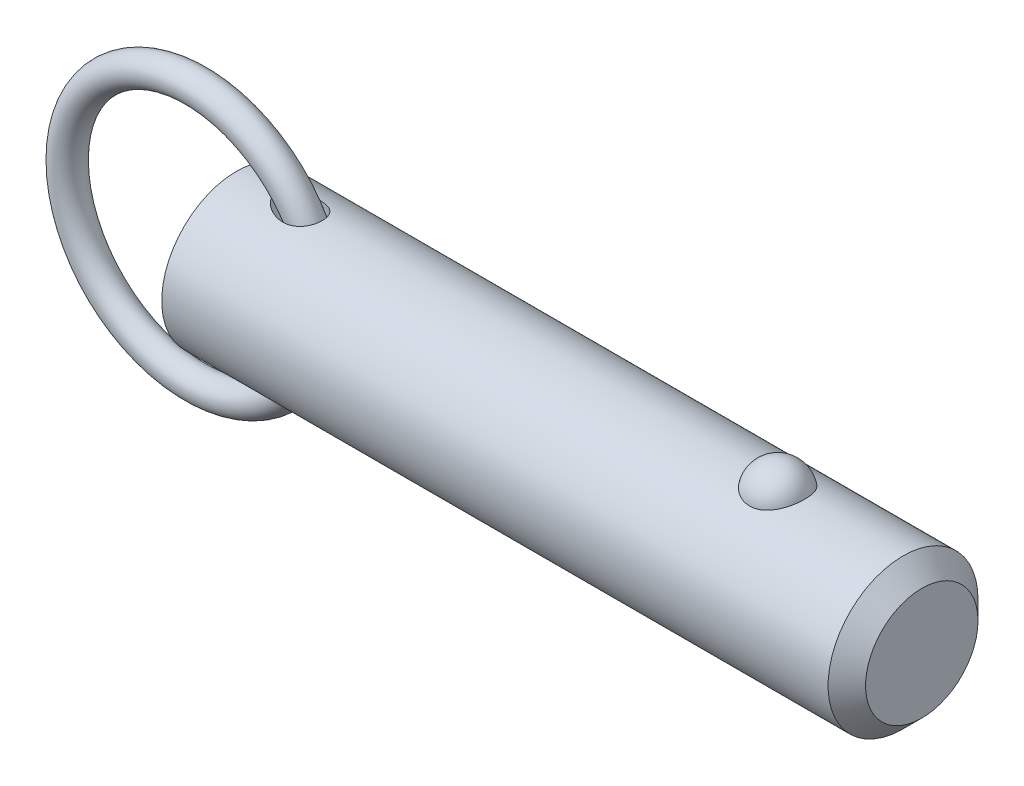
ISO-10303-21;
HEADER;
FILE_DESCRIPTION(('STEP AP214'),'2;1');
FILE_NAME('part.step','',(''),(''),'','','');
FILE_SCHEMA(('AUTOMOTIVE_DESIGN { 1 0 10303 214 1 1 1 1 }'));
ENDSEC;
DATA;
#1=APPLICATION_CONTEXT('core data for automotive mechanical design processes');
#2=APPLICATION_PROTOCOL_DEFINITION('international standard','automotive_design',2000,#1);
#3=PRODUCT_CONTEXT('',#1,'mechanical');
#4=PRODUCT('Part','Part','',(#3));
#5=PRODUCT_RELATED_PRODUCT_CATEGORY('part','',(#4));
#6=PRODUCT_DEFINITION_FORMATION('','',#4);
#7=PRODUCT_DEFINITION_CONTEXT('part definition',#1,'design');
#8=PRODUCT_DEFINITION('design','',#6,#7);
#9=PRODUCT_DEFINITION_SHAPE('','',#8);
#10=(LENGTH_UNIT() NAMED_UNIT(*) SI_UNIT(.MILLI.,.METRE.));
#11=(NAMED_UNIT(*) PLANE_ANGLE_UNIT() SI_UNIT($,.RADIAN.));
#12=(NAMED_UNIT(*) SI_UNIT($,.STERADIAN.) SOLID_ANGLE_UNIT());
#13=UNCERTAINTY_MEASURE_WITH_UNIT(LENGTH_MEASURE(1.E-05),#10,'distance_accuracy_value','');
#14=(GEOMETRIC_REPRESENTATION_CONTEXT(3) GLOBAL_UNCERTAINTY_ASSIGNED_CONTEXT((#13)) GLOBAL_UNIT_ASSIGNED_CONTEXT((#10,
#11,#12)) REPRESENTATION_CONTEXT('',''));
#15=CARTESIAN_POINT('',(0.,0.,0.));
#16=DIRECTION('',(0.,0.,1.));
#17=DIRECTION('',(1.,0.,0.));
#18=AXIS2_PLACEMENT_3D('',#15,#16,#17);
#19=CARTESIAN_POINT('',(-6.08699288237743,0.,0.));
#20=DIRECTION('',(0.,0.,1.));
#21=DIRECTION('',(1.,0.,0.));
#22=AXIS2_PLACEMENT_3D('',#19,#20,#21);
#23=TOROIDAL_SURFACE('',#22,19.05,2.223);
#24=CARTESIAN_POINT('',(15.1860071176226,0.,0.));
#25=VERTEX_POINT('',#24);
#26=VERTEX_LOOP('',#25);
#27=FACE_BOUND('',#26,.T.);
#28=ADVANCED_FACE('P0_F12',(#27),#23,.T.);
#29=CLOSED_SHELL('',(#28));
#30=MANIFOLD_SOLID_BREP('P0_B1',#29);
#31=CARTESIAN_POINT('',(0.,0.,0.));
#32=DIRECTION('',(1.,0.,0.));
#33=DIRECTION('',(0.,0.,-1.));
#34=AXIS2_PLACEMENT_3D('',#31,#32,#33);
#35=CYLINDRICAL_SURFACE('',#34,11.115);
#36=CARTESIAN_POINT('',(6.414051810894,11.0227946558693,-1.42871369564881));
#37=CARTESIAN_POINT('',(6.49338916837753,11.0115377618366,-1.5155664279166));
#38=CARTESIAN_POINT('',(6.57765461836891,10.9998263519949,-1.59789397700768));
#39=CARTESIAN_POINT('',(6.75386647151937,10.9760304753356,-1.75391400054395));
#40=CARTESIAN_POINT('',(6.84582247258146,10.9639455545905,-1.82759540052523));
#41=CARTESIAN_POINT('',(7.03627827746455,10.9397989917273,-1.96698954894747));
#42=CARTESIAN_POINT('',(7.13480838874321,10.9277377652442,-2.03266078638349));
#43=CARTESIAN_POINT('',(7.33681032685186,10.9041015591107,-2.1558582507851));
#44=CARTESIAN_POINT('',(7.44028007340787,10.8925263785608,-2.21338786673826));
#45=CARTESIAN_POINT('',(7.64386117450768,10.8710104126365,-2.31666528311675));
#46=CARTESIAN_POINT('',(7.74368989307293,10.8610119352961,-2.36295942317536));
#47=CARTESIAN_POINT('',(7.94637195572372,10.8420168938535,-2.44863486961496));
#48=CARTESIAN_POINT('',(8.04922612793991,10.8330206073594,-2.48801426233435));
#49=CARTESIAN_POINT('',(8.36115573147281,10.807980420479,-2.59542730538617));
#50=CARTESIAN_POINT('',(8.57411849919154,10.7938278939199,-2.65299817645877));
#51=CARTESIAN_POINT('',(9.00825016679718,10.7725818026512,-2.73800108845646));
#52=CARTESIAN_POINT('',(9.22947335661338,10.7655491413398,-2.76517330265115));
#53=CARTESIAN_POINT('',(9.67368141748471,10.7605872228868,-2.78445308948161));
#54=CARTESIAN_POINT('',(9.89666486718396,10.7626512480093,-2.77658653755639));
#55=CARTESIAN_POINT('',(10.2950172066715,10.7754452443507,-2.72644436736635));
#56=CARTESIAN_POINT('',(10.4712789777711,10.7844280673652,-2.69109376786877));
#57=CARTESIAN_POINT('',(10.7292776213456,10.8024982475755,-2.61722365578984));
#58=CARTESIAN_POINT('',(10.8142337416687,10.8092901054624,-2.58911576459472));
#59=CARTESIAN_POINT('',(10.9813218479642,10.8242580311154,-2.52581287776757));
#60=CARTESIAN_POINT('',(11.0634550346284,10.8324335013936,-2.49062094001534));
#61=CARTESIAN_POINT('',(11.2247418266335,10.8500287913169,-2.41281958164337));
#62=CARTESIAN_POINT('',(11.3038694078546,10.8594572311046,-2.37015806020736));
#63=CARTESIAN_POINT('',(11.4576781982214,10.8792243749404,-2.27770403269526));
#64=CARTESIAN_POINT('',(11.5323615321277,10.8895626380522,-2.22791497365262));
#65=CARTESIAN_POINT('',(11.6765388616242,10.9108113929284,-2.12140590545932));
#66=CARTESIAN_POINT('',(11.7460329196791,10.9217218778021,-2.064685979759));
#67=CARTESIAN_POINT('',(11.8790597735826,10.9437207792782,-1.94471764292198));
#68=CARTESIAN_POINT('',(11.9425932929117,10.9548091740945,-1.88147002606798));
#69=CARTESIAN_POINT('',(12.109388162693,10.9851999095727,-1.69784918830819));
#70=CARTESIAN_POINT('',(12.205655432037,11.0042655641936,-1.57093023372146));
#71=CARTESIAN_POINT('',(12.374151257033,11.0393391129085,-1.3017676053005));
#72=CARTESIAN_POINT('',(12.4463875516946,11.0553479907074,-1.15952888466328));
#73=CARTESIAN_POINT('',(12.5615818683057,11.0816338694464,-0.871972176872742));
#74=CARTESIAN_POINT('',(12.6058896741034,11.0921698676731,-0.72721773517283));
#75=CARTESIAN_POINT('',(12.6699315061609,11.1075802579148,-0.432089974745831));
#76=CARTESIAN_POINT('',(12.6896681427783,11.1124552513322,-0.281717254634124));
#77=CARTESIAN_POINT('',(12.704022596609,11.1159901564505,0.0188164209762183));
#78=CARTESIAN_POINT('',(12.6988836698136,11.1147102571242,0.16896512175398));
#79=CARTESIAN_POINT('',(12.6641681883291,11.1062126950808,0.466238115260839));
#80=CARTESIAN_POINT('',(12.6345920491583,11.0989951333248,0.613362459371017));
#81=CARTESIAN_POINT('',(12.5517453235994,11.0794095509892,0.900330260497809));
#82=CARTESIAN_POINT('',(12.4984878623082,11.0670443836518,1.04017770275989));
#83=CARTESIAN_POINT('',(12.3696588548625,11.0385082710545,1.308745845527));
#84=CARTESIAN_POINT('',(12.2940887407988,11.0223375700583,1.43746725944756));
#85=CARTESIAN_POINT('',(12.122380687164,10.987872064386,1.68079704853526));
#86=CARTESIAN_POINT('',(12.0261637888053,10.969569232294,1.79534850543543));
#87=CARTESIAN_POINT('',(11.8161707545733,10.932836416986,2.00695695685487));
#88=CARTESIAN_POINT('',(11.7023941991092,10.9144064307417,2.10401353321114));
#89=CARTESIAN_POINT('',(11.4575656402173,10.8788057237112,2.28105326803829));
#90=CARTESIAN_POINT('',(11.3261451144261,10.8616794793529,2.36053412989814));
#91=CARTESIAN_POINT('',(11.0523589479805,10.8308019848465,2.49839044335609));
#92=CARTESIAN_POINT('',(10.9099908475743,10.8170514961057,2.55676113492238));
#93=CARTESIAN_POINT('',(10.6060622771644,10.7929728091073,2.65666105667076));
#94=CARTESIAN_POINT('',(10.4438877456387,10.7830209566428,2.69640163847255));
#95=CARTESIAN_POINT('',(10.1154037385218,10.7687230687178,2.75293129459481));
#96=CARTESIAN_POINT('',(9.94909141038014,10.7643810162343,2.76970406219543));
#97=CARTESIAN_POINT('',(9.54387061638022,10.7604809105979,2.7848723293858));
#98=CARTESIAN_POINT('',(9.30446860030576,10.7637793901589,2.7722775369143));
#99=CARTESIAN_POINT('',(8.94961255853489,10.7757341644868,2.72524141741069));
#100=CARTESIAN_POINT('',(8.83186896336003,10.7808994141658,2.70482239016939));
#101=CARTESIAN_POINT('',(8.59835142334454,10.7932548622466,2.6550999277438));
#102=CARTESIAN_POINT('',(8.48257728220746,10.8004448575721,2.62579738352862));
#103=CARTESIAN_POINT('',(8.25208469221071,10.8166382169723,2.55827624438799));
#104=CARTESIAN_POINT('',(8.13740214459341,10.8256649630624,2.51994155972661));
#105=CARTESIAN_POINT('',(7.91132058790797,10.8451170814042,2.43486475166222));
#106=CARTESIAN_POINT('',(7.79992154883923,10.8555424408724,2.38812270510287));
#107=CARTESIAN_POINT('',(7.58115677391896,10.8774251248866,2.28638483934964));
#108=CARTESIAN_POINT('',(7.47378802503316,10.8888816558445,2.23139534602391));
#109=CARTESIAN_POINT('',(7.26385624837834,10.9124540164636,2.1131026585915));
#110=CARTESIAN_POINT('',(7.16129168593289,10.9245696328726,2.04980214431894));
#111=CARTESIAN_POINT('',(6.91882218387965,10.9543689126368,1.88540538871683));
#112=CARTESIAN_POINT('',(6.78193778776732,10.9721958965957,1.77979827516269));
#113=CARTESIAN_POINT('',(6.52472441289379,11.0070222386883,1.54989693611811));
#114=CARTESIAN_POINT('',(6.40436902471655,11.0240228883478,1.42563320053));
#115=CARTESIAN_POINT('',(6.21838804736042,11.0509658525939,1.19529359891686));
#116=CARTESIAN_POINT('',(6.14691885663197,11.0615430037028,1.09404520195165));
#117=CARTESIAN_POINT('',(6.02043496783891,11.0805004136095,0.881508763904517));
#118=CARTESIAN_POINT('',(5.96539400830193,11.0888841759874,0.770237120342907));
#119=CARTESIAN_POINT('',(5.88475453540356,11.1012553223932,0.560577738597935));
#120=CARTESIAN_POINT('',(5.85559643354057,11.1057686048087,0.463603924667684));
#121=CARTESIAN_POINT('',(5.81381299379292,11.1122523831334,0.266083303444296));
#122=CARTESIAN_POINT('',(5.80117118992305,11.1142254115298,0.165540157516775));
#123=CARTESIAN_POINT('',(5.79363815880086,11.1153999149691,-0.0364747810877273));
#124=CARTESIAN_POINT('',(5.79878799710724,11.1145949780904,-0.137948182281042));
#125=CARTESIAN_POINT('',(5.82639592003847,11.1102987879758,-0.338493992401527));
#126=CARTESIAN_POINT('',(5.84887234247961,11.1068046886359,-0.437563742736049));
#127=CARTESIAN_POINT('',(5.91510741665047,11.0965857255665,-0.649968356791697));
#128=CARTESIAN_POINT('',(5.96220905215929,11.0893566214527,-0.762222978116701));
#129=CARTESIAN_POINT('',(6.0737844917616,11.072471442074,-0.977396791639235));
#130=CARTESIAN_POINT('',(6.13826787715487,11.0628140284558,-1.08031079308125));
#131=CARTESIAN_POINT('',(6.24101077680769,11.0477136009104,-1.2219580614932));
#132=CARTESIAN_POINT('',(6.27403486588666,11.042895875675,-1.26469183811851));
#133=CARTESIAN_POINT('',(6.34238022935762,11.0330152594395,-1.34817011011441));
#134=CARTESIAN_POINT('',(6.37769867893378,11.0279526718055,-1.38891694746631));
#135=CARTESIAN_POINT('',(6.414051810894,11.0227946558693,-1.42871369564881));
#136=B_SPLINE_CURVE_WITH_KNOTS('',3,(#36,#37,#38,#39,#40,#41,#42,#43,#44,#45,#46,#47,#48,#49,
#50,#51,#52,#53,#54,#55,#56,#57,#58,#59,#60,#61,#62,#63,#64,#65,#66,#67,#68,#69,#70,#71,#72,#73,
#74,#75,#76,#77,#78,#79,#80,#81,#82,#83,#84,#85,#86,#87,#88,#89,#90,#91,#92,#93,#94,#95,#96,#97,
#98,#99,#100,#101,#102,#103,#104,#105,#106,#107,#108,#109,#110,#111,#112,#113,#114,#115,#116,
#117,#118,#119,#120,#121,#122,#123,#124,#125,#126,#127,#128,#129,#130,#131,#132,#133,#134,#135),
.UNSPECIFIED.,.T.,.F.,(4,2,2,2,2,2,2,2,2,2,2,2,2,2,2,2,2,2,2,2,2,2,2,2,2,2,2,2,2,2,2,2,2,2,2,2,
2,2,2,2,2,2,2,2,2,2,2,2,2,4),(0.,0.354433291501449,0.709315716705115,1.0659654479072,
1.42246628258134,1.75367157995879,2.08496839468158,2.74582009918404,3.41227815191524,
4.07824412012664,4.61583787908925,4.88478112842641,5.15360853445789,5.42439170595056,
5.6950443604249,5.96569375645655,6.23631025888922,6.7149072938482,7.1933500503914,
7.6464143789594,8.09943057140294,8.54802575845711,8.99661331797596,9.44495256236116,
9.89326303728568,10.3433195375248,10.7933867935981,11.2550086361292,11.7167345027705,
12.2165866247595,12.7167934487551,13.4318876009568,13.7904664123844,14.1490092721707,
14.5124394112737,14.8758662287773,15.239015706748,15.6020483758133,16.1219860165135,
16.6410830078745,17.0130520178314,17.3844231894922,17.6872330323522,17.9897407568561,
18.2929471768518,18.5964749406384,18.9603532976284,19.3244326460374,19.4870338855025,
19.649438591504),.UNSPECIFIED.);
#137=CARTESIAN_POINT('',(6.414051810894,11.0227946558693,-1.42871369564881));
#138=VERTEX_POINT('',#137);
#139=EDGE_CURVE('P1_E40',#138,#138,#136,.T.);
#140=ORIENTED_EDGE('',*,*,#139,.T.);
#141=EDGE_LOOP('',(#140));
#142=FACE_BOUND('',#141,.T.);
#143=CARTESIAN_POINT('',(98.82125,0.,0.));
#144=DIRECTION('',(1.,0.,0.));
#145=DIRECTION('',(0.,0.,-1.));
#146=AXIS2_PLACEMENT_3D('',#143,#144,#145);
#147=CIRCLE('',#146,11.115);
#148=CARTESIAN_POINT('',(98.82125,0.,-11.115));
#149=VERTEX_POINT('',#148);
#150=EDGE_CURVE('P1_E25',#149,#149,#147,.T.);
#151=ORIENTED_EDGE('',*,*,#150,.F.);
#152=EDGE_LOOP('',(#151));
#153=FACE_BOUND('',#152,.T.);
#154=CARTESIAN_POINT('',(0.,0.,0.));
#155=DIRECTION('',(1.,0.,0.));
#156=DIRECTION('',(0.,0.,-1.));
#157=AXIS2_PLACEMENT_3D('',#154,#155,#156);
#158=CIRCLE('',#157,11.115);
#159=CARTESIAN_POINT('',(0.,0.,-11.115));
#160=VERTEX_POINT('',#159);
#161=EDGE_CURVE('P1_E9',#160,#160,#158,.T.);
#162=ORIENTED_EDGE('',*,*,#161,.T.);
#163=EDGE_LOOP('',(#162));
#164=FACE_BOUND('',#163,.T.);
#165=CARTESIAN_POINT('',(80.2310680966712,10.3028087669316,4.17077409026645));
#166=CARTESIAN_POINT('',(80.0147756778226,10.3028003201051,4.17078240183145));
#167=CARTESIAN_POINT('',(79.7985488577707,10.3098895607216,4.15340593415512));
#168=CARTESIAN_POINT('',(79.3725408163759,10.3373834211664,4.08449540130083));
#169=CARTESIAN_POINT('',(79.1627577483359,10.3577841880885,4.0329712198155));
#170=CARTESIAN_POINT('',(78.7557825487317,10.4095237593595,3.89746513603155));
#171=CARTESIAN_POINT('',(78.5585726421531,10.4408466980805,3.81353029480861));
#172=CARTESIAN_POINT('',(78.1813382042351,10.5110236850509,3.61560339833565));
#173=CARTESIAN_POINT('',(78.0013171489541,10.5498792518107,3.50160528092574));
#174=CARTESIAN_POINT('',(77.6576842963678,10.6322884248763,3.24292464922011));
#175=CARTESIAN_POINT('',(77.4946861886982,10.6759443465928,3.09746040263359));
#176=CARTESIAN_POINT('',(77.1945911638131,10.7625291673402,2.78171925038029));
#177=CARTESIAN_POINT('',(77.0574990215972,10.8054579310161,2.61143778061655));
#178=CARTESIAN_POINT('',(76.8064084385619,10.8881935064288,2.24226695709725));
#179=CARTESIAN_POINT('',(76.6937105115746,10.9277761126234,2.04244123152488));
#180=CARTESIAN_POINT('',(76.5017771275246,10.997484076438,1.62578254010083));
#181=CARTESIAN_POINT('',(76.4225446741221,11.0276085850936,1.40894804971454));
#182=CARTESIAN_POINT('',(76.2983034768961,11.0756732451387,0.961250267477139));
#183=CARTESIAN_POINT('',(76.253760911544,11.0934470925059,0.730239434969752));
#184=CARTESIAN_POINT('',(76.2015695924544,11.1143331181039,0.263439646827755));
#185=CARTESIAN_POINT('',(76.1939200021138,11.1174456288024,0.0276507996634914));
#186=CARTESIAN_POINT('',(76.2156105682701,11.1087161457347,-0.440729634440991));
#187=CARTESIAN_POINT('',(76.2447624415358,11.0969502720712,-0.673331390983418));
#188=CARTESIAN_POINT('',(76.3391432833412,11.0597872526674,-1.12996621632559));
#189=CARTESIAN_POINT('',(76.4043729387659,11.0343898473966,-1.35399912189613));
#190=CARTESIAN_POINT('',(76.5696984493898,10.972515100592,-1.78750286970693));
#191=CARTESIAN_POINT('',(76.6698386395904,10.9360236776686,-1.99695478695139));
#192=CARTESIAN_POINT('',(76.9029408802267,10.8557595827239,-2.3952066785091));
#193=CARTESIAN_POINT('',(77.035905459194,10.8119863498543,-2.5840050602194));
#194=CARTESIAN_POINT('',(77.3324076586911,10.7216733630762,-2.93635726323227));
#195=CARTESIAN_POINT('',(77.4960565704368,10.675123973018,-3.09981510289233));
#196=CARTESIAN_POINT('',(77.8498601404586,10.5846571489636,-3.39592247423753));
#197=CARTESIAN_POINT('',(78.0400123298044,10.5407394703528,-3.52857487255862));
#198=CARTESIAN_POINT('',(78.4375014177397,10.4616690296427,-3.75646057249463));
#199=CARTESIAN_POINT('',(78.6443670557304,10.4263443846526,-3.8524543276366));
#200=CARTESIAN_POINT('',(79.0729541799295,10.3675574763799,-4.00798747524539));
#201=CARTESIAN_POINT('',(79.294670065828,10.344090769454,-4.0675405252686));
#202=CARTESIAN_POINT('',(79.7346695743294,10.3128282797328,-4.14614314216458));
#203=CARTESIAN_POINT('',(79.9525654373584,10.3043040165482,-4.1670783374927));
#204=CARTESIAN_POINT('',(80.38894951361,10.3016771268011,-4.17357158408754));
#205=CARTESIAN_POINT('',(80.6074376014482,10.3075716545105,-4.15913661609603));
#206=CARTESIAN_POINT('',(81.0317442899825,10.3326686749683,-4.09636961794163));
#207=CARTESIAN_POINT('',(81.2377458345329,10.3514555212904,-4.0490957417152));
#208=CARTESIAN_POINT('',(81.6385764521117,10.399818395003,-3.92320197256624));
#209=CARTESIAN_POINT('',(81.8334046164,10.4293952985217,-3.84457953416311));
#210=CARTESIAN_POINT('',(82.2111917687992,10.4969600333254,-3.65612410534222));
#211=CARTESIAN_POINT('',(82.3937974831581,10.5351178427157,-3.54564545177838));
#212=CARTESIAN_POINT('',(82.7382040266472,10.6154999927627,-3.29718036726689));
#213=CARTESIAN_POINT('',(82.900000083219,10.657725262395,-3.15918764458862));
#214=CARTESIAN_POINT('',(83.2069596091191,10.744212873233,-2.85163580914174));
#215=CARTESIAN_POINT('',(83.3508919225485,10.7884718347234,-2.68084605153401));
#216=CARTESIAN_POINT('',(83.6092371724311,10.872374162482,-2.3172186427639));
#217=CARTESIAN_POINT('',(83.7236448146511,10.9120167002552,-2.12437704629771));
#218=CARTESIAN_POINT('',(83.9238739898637,10.9838919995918,-1.71516999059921));
#219=CARTESIAN_POINT('',(84.0086617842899,11.0158465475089,-1.498248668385));
#220=CARTESIAN_POINT('',(84.1426838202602,11.0673523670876,-1.05228572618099));
#221=CARTESIAN_POINT('',(84.1919174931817,11.086903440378,-0.823243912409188));
#222=CARTESIAN_POINT('',(84.2538915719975,11.1116323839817,-0.359087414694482));
#223=CARTESIAN_POINT('',(84.2665662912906,11.1167843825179,-0.123962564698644));
#224=CARTESIAN_POINT('',(84.254973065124,11.1121144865,0.345220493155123));
#225=CARTESIAN_POINT('',(84.2307056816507,11.1022928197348,0.579278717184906));
#226=CARTESIAN_POINT('',(84.1459073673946,11.0687504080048,1.03866534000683));
#227=CARTESIAN_POINT('',(84.0855299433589,11.0450885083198,1.26402641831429));
#228=CARTESIAN_POINT('',(83.9298532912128,10.9863185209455,1.70076772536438));
#229=CARTESIAN_POINT('',(83.834551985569,10.9512097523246,1.91214712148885));
#230=CARTESIAN_POINT('',(83.6103974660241,10.8729733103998,2.31608359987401));
#231=CARTESIAN_POINT('',(83.4813806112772,10.8298068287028,2.50854240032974));
#232=CARTESIAN_POINT('',(83.1927327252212,10.7401896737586,2.86808766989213));
#233=CARTESIAN_POINT('',(83.0331022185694,10.6937390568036,3.03517457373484));
#234=CARTESIAN_POINT('',(82.6875341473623,10.6029321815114,3.33857581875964));
#235=CARTESIAN_POINT('',(82.5017089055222,10.5585680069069,3.47501541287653));
#236=CARTESIAN_POINT('',(82.1078750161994,10.4769321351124,3.71390897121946));
#237=CARTESIAN_POINT('',(81.8998635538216,10.439661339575,3.81635861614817));
#238=CARTESIAN_POINT('',(81.4540666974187,10.3749407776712,3.98910631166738));
#239=CARTESIAN_POINT('',(81.2152342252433,10.3482457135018,4.05700929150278));
#240=CARTESIAN_POINT('',(80.7279254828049,10.312188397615,4.14782844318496));
#241=CARTESIAN_POINT('',(80.4794535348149,10.3028184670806,4.17076454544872));
#242=CARTESIAN_POINT('',(80.2310680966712,10.3028087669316,4.17077409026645));
#243=B_SPLINE_CURVE_WITH_KNOTS('',3,(#165,#166,#167,#168,#169,#170,#171,#172,#173,#174,#175,
#176,#177,#178,#179,#180,#181,#182,#183,#184,#185,#186,#187,#188,#189,#190,#191,#192,#193,#194,
#195,#196,#197,#198,#199,#200,#201,#202,#203,#204,#205,#206,#207,#208,#209,#210,#211,#212,#213,
#214,#215,#216,#217,#218,#219,#220,#221,#222,#223,#224,#225,#226,#227,#228,#229,#230,#231,#232,
#233,#234,#235,#236,#237,#238,#239,#240,#241,#242),.UNSPECIFIED.,.T.,.F.,(4,2,2,2,2,2,2,2,2,2,2,
2,2,2,2,2,2,2,2,2,2,2,2,2,2,2,2,2,2,2,2,2,2,2,2,2,2,2,4),(0.,0.647966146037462,1.29574482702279,
1.94258643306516,2.58955857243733,3.25496465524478,3.92049326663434,4.61566368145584,
5.31089647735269,6.01531821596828,6.71972398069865,7.42054043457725,8.12137023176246,
8.82309331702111,9.52487047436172,10.2292439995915,10.9335519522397,11.6223330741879,
12.3108558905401,12.9647664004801,13.6185478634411,14.2521847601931,14.8858731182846,
15.5334360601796,16.1811472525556,16.8611459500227,17.5412664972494,18.2431855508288,
18.9451158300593,19.6483065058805,20.3514864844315,21.0516982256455,21.7519516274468,
22.4556690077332,23.1593743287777,23.8601491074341,24.5610129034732,25.3054529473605,
26.049562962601),.UNSPECIFIED.);
#244=CARTESIAN_POINT('',(80.2310680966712,10.3028087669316,4.17077409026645));
#245=VERTEX_POINT('',#244);
#246=EDGE_CURVE('P1_E34',#245,#245,#243,.T.);
#247=ORIENTED_EDGE('',*,*,#246,.T.);
#248=EDGE_LOOP('',(#247));
#249=FACE_BOUND('',#248,.T.);
#250=CARTESIAN_POINT('',(6.414051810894,-11.0227946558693,-1.42871369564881));
#251=CARTESIAN_POINT('',(6.3312406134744,-11.0345445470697,-1.33806125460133));
#252=CARTESIAN_POINT('',(6.25372866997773,-11.0458090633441,-1.24240732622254));
#253=CARTESIAN_POINT('',(6.11277905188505,-11.0666115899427,-1.04095704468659));
#254=CARTESIAN_POINT('',(6.04933920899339,-11.0761498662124,-0.935162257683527));
#255=CARTESIAN_POINT('',(5.94029181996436,-11.0927063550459,-0.712476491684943));
#256=CARTESIAN_POINT('',(5.89492964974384,-11.0996897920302,-0.595457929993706));
#257=CARTESIAN_POINT('',(5.8449816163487,-11.1074141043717,-0.414997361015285));
#258=CARTESIAN_POINT('',(5.83135004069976,-11.1095300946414,-0.354047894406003));
#259=CARTESIAN_POINT('',(5.81051649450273,-11.1127688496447,-0.23104152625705));
#260=CARTESIAN_POINT('',(5.80331311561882,-11.1138918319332,-0.168984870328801));
#261=CARTESIAN_POINT('',(5.7929652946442,-11.1155042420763,-0.000484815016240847));
#262=CARTESIAN_POINT('',(5.79625267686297,-11.1149904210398,0.106437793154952));
#263=CARTESIAN_POINT('',(5.82213676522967,-11.1109609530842,0.317809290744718));
#264=CARTESIAN_POINT('',(5.84474662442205,-11.1074432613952,0.422256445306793));
#265=CARTESIAN_POINT('',(5.91113114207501,-11.097197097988,0.639361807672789));
#266=CARTESIAN_POINT('',(5.95733120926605,-11.090102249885,0.751250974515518));
#267=CARTESIAN_POINT('',(6.06709542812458,-11.0734770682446,0.965912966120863));
#268=CARTESIAN_POINT('',(6.13068735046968,-11.06394284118,1.06867085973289));
#269=CARTESIAN_POINT('',(6.30294237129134,-11.0385920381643,1.30890635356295));
#270=CARTESIAN_POINT('',(6.41896200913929,-11.0218881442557,1.44097376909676));
#271=CARTESIAN_POINT('',(6.66989654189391,-10.9871512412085,1.68553954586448));
#272=CARTESIAN_POINT('',(6.80485520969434,-10.9691152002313,1.79799117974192));
#273=CARTESIAN_POINT('',(7.04881236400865,-10.9382283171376,1.97587596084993));
#274=CARTESIAN_POINT('',(7.15465712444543,-10.9253240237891,2.04570822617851));
#275=CARTESIAN_POINT('',(7.37202504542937,-10.9000987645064,2.17611840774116));
#276=CARTESIAN_POINT('',(7.48355057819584,-10.8877780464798,2.23669241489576));
#277=CARTESIAN_POINT('',(7.71132418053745,-10.8641580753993,2.34873831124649));
#278=CARTESIAN_POINT('',(7.82757727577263,-10.8528599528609,2.40020018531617));
#279=CARTESIAN_POINT('',(8.06386825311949,-10.8317234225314,2.49385169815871));
#280=CARTESIAN_POINT('',(8.18390558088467,-10.8218848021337,2.53604268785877));
#281=CARTESIAN_POINT('',(8.42918336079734,-10.8039208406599,2.61152283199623));
#282=CARTESIAN_POINT('',(8.55447802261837,-10.7958283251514,2.64464414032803));
#283=CARTESIAN_POINT('',(8.8075212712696,-10.781995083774,2.70048793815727));
#284=CARTESIAN_POINT('',(8.93527019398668,-10.7762546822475,2.72320899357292));
#285=CARTESIAN_POINT('',(9.19210176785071,-10.7675291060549,2.75750994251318));
#286=CARTESIAN_POINT('',(9.32118105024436,-10.7645381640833,2.76911315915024));
#287=CARTESIAN_POINT('',(9.57984338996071,-10.761622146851,2.78042035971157));
#288=CARTESIAN_POINT('',(9.70942621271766,-10.7616957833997,2.78012934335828));
#289=CARTESIAN_POINT('',(10.0243125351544,-10.7659059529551,2.76381534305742));
#290=CARTESIAN_POINT('',(10.209307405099,-10.7717977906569,2.74099674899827));
#291=CARTESIAN_POINT('',(10.5731188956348,-10.7905408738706,2.66626238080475));
#292=CARTESIAN_POINT('',(10.7519389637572,-10.8033881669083,2.61436313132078));
#293=CARTESIAN_POINT('',(11.0114289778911,-10.8271584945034,2.51336808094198));
#294=CARTESIAN_POINT('',(11.096831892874,-10.835881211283,2.47562331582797));
#295=CARTESIAN_POINT('',(11.2636000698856,-10.8545688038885,2.39236170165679));
#296=CARTESIAN_POINT('',(11.3449673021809,-10.8645330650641,2.3468486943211));
#297=CARTESIAN_POINT('',(11.5027832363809,-10.8853818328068,2.24815967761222));
#298=CARTESIAN_POINT('',(11.5792327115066,-10.8962661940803,2.19498487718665));
#299=CARTESIAN_POINT('',(11.7263315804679,-10.9185541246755,2.08128855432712));
#300=CARTESIAN_POINT('',(11.7969818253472,-10.9299576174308,2.02076811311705));
#301=CARTESIAN_POINT('',(11.9817953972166,-10.9613645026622,1.84513663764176));
#302=CARTESIAN_POINT('',(12.0893012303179,-10.9814643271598,1.72286660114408));
#303=CARTESIAN_POINT('',(12.2803576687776,-11.0193991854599,1.46066991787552));
#304=CARTESIAN_POINT('',(12.3639173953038,-11.0372350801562,1.3207500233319));
#305=CARTESIAN_POINT('',(12.4996220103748,-11.0672969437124,1.03778067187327));
#306=CARTESIAN_POINT('',(12.5535315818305,-11.0798242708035,0.895607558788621));
#307=CARTESIAN_POINT('',(12.636874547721,-11.0995427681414,0.603918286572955));
#308=CARTESIAN_POINT('',(12.6663115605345,-11.1067347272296,0.454403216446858));
#309=CARTESIAN_POINT('',(12.6997387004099,-11.1149224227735,0.154577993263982));
#310=CARTESIAN_POINT('',(12.7040886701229,-11.1160057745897,0.00431019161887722));
#311=CARTESIAN_POINT('',(12.6882048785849,-11.1120956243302,-0.29484108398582));
#312=CARTESIAN_POINT('',(12.6679715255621,-11.1071022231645,-0.443724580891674));
#313=CARTESIAN_POINT('',(12.6034470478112,-11.0915888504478,-0.735688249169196));
#314=CARTESIAN_POINT('',(12.5591858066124,-11.0810757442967,-0.878775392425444));
#315=CARTESIAN_POINT('',(12.4477416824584,-11.0556687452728,-1.15529525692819));
#316=CARTESIAN_POINT('',(12.3805601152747,-11.0407751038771,-1.2887285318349));
#317=CARTESIAN_POINT('',(12.2248919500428,-11.0081839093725,-1.54257976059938));
#318=CARTESIAN_POINT('',(12.1363549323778,-10.9904797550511,-1.66296592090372));
#319=CARTESIAN_POINT('',(11.9406137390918,-10.9541951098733,-1.88726577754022));
#320=CARTESIAN_POINT('',(11.833409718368,-10.9356146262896,-1.99117961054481));
#321=CARTESIAN_POINT('',(11.601318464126,-10.8991360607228,-2.18213646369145));
#322=CARTESIAN_POINT('',(11.4761325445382,-10.8812577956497,-2.26881927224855));
#323=CARTESIAN_POINT('',(11.2134852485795,-10.8482871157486,-2.42157282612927));
#324=CARTESIAN_POINT('',(11.0760218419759,-10.8331951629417,-2.48764015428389));
#325=CARTESIAN_POINT('',(10.7828968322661,-10.8061050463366,-2.60290068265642));
#326=CARTESIAN_POINT('',(10.6266338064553,-10.7943907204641,-2.65062248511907));
#327=CARTESIAN_POINT('',(10.3086617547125,-10.7762429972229,-2.72345054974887));
#328=CARTESIAN_POINT('',(10.146948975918,-10.7698133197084,-2.74854088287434));
#329=CARTESIAN_POINT('',(9.75541304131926,-10.7608036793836,-2.78368719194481));
#330=CARTESIAN_POINT('',(9.52459435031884,-10.7608467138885,-2.78350276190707));
#331=CARTESIAN_POINT('',(9.06604960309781,-10.7702674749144,-2.74677945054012));
#332=CARTESIAN_POINT('',(8.83832966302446,-10.7796615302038,-2.71017697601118));
#333=CARTESIAN_POINT('',(8.38783466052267,-10.8058248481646,-2.60392490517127));
#334=CARTESIAN_POINT('',(8.1651710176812,-10.8226939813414,-2.53382676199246));
#335=CARTESIAN_POINT('',(7.84087311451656,-10.8516548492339,-2.40555545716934));
#336=CARTESIAN_POINT('',(7.73435551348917,-10.8619221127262,-2.35892455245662));
#337=CARTESIAN_POINT('',(7.52510420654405,-10.883357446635,-2.25797017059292));
#338=CARTESIAN_POINT('',(7.4223698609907,-10.8945253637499,-2.20364800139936));
#339=CARTESIAN_POINT('',(7.23808758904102,-10.915528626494,-2.09688018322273));
#340=CARTESIAN_POINT('',(7.15584631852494,-10.9252787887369,-2.0456107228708));
#341=CARTESIAN_POINT('',(6.99510576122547,-10.944960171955,-1.93754729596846));
#342=CARTESIAN_POINT('',(6.91660574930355,-10.9548913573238,-1.88075440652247));
#343=CARTESIAN_POINT('',(6.76418133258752,-10.974690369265,-1.76154504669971));
#344=CARTESIAN_POINT('',(6.69024940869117,-10.9845582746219,-1.6991382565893));
#345=CARTESIAN_POINT('',(6.54780119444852,-11.0039826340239,-1.56842485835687));
#346=CARTESIAN_POINT('',(6.47928247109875,-11.0135392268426,-1.50012092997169));
#347=CARTESIAN_POINT('',(6.414051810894,-11.0227946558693,-1.42871369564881));
#348=B_SPLINE_CURVE_WITH_KNOTS('',3,(#250,#251,#252,#253,#254,#255,#256,#257,#258,#259,#260,
#261,#262,#263,#264,#265,#266,#267,#268,#269,#270,#271,#272,#273,#274,#275,#276,#277,#278,#279,
#280,#281,#282,#283,#284,#285,#286,#287,#288,#289,#290,#291,#292,#293,#294,#295,#296,#297,#298,
#299,#300,#301,#302,#303,#304,#305,#306,#307,#308,#309,#310,#311,#312,#313,#314,#315,#316,#317,
#318,#319,#320,#321,#322,#323,#324,#325,#326,#327,#328,#329,#330,#331,#332,#333,#334,#335,#336,
#337,#338,#339,#340,#341,#342,#343,#344,#345,#346,#347),.UNSPECIFIED.,.T.,.F.,(4,2,2,2,2,2,2,2,
2,2,2,2,2,2,2,2,2,2,2,2,2,2,2,2,2,2,2,2,2,2,2,2,2,2,2,2,2,2,2,2,2,2,2,2,2,2,2,2,4),(0.,
0.369835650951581,0.739614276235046,1.1142538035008,1.30141910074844,1.48854338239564,
1.8074587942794,2.12659146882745,2.4883888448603,2.85076733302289,3.3776216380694,
3.90571433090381,4.287639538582,4.66972556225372,5.05222896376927,5.43467659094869,
5.82378546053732,6.21294796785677,6.60129228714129,6.9894733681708,7.54669558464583,
8.10360148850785,8.38458539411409,8.66543074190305,8.94623182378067,9.22699162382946,
9.7162888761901,10.2053995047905,10.6608871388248,11.1163074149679,11.5651786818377,
12.0140424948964,12.4623493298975,12.9106304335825,13.3599804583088,13.8093267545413,
14.2672570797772,14.7252632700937,15.214740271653,15.7045615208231,16.3932594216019,
17.083162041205,17.7825738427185,18.1325177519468,18.4824022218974,18.7744056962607,
19.0663523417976,19.3578048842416,19.6491256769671),.UNSPECIFIED.);
#349=CARTESIAN_POINT('',(6.414051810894,-11.0227946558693,-1.42871369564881));
#350=VERTEX_POINT('',#349);
#351=EDGE_CURVE('P1_E17',#350,#350,#348,.T.);
#352=ORIENTED_EDGE('',*,*,#351,.T.);
#353=EDGE_LOOP('',(#352));
#354=FACE_BOUND('',#353,.T.);
#355=ADVANCED_FACE('P1_F13',(#142,#153,#164,#249,#354),#35,.T.);
#356=CARTESIAN_POINT('',(0.,0.,0.));
#357=DIRECTION('',(-1.,0.,0.));
#358=DIRECTION('',(0.,0.,1.));
#359=AXIS2_PLACEMENT_3D('',#356,#357,#358);
#360=PLANE('',#359);
#361=ORIENTED_EDGE('',*,*,#161,.F.);
#362=EDGE_LOOP('',(#361));
#363=FACE_BOUND('',#362,.T.);
#364=ADVANCED_FACE('P1_F15',(#363),#360,.T.);
#365=CARTESIAN_POINT('',(101.6,0.,0.));
#366=DIRECTION('',(-1.,0.,0.));
#367=DIRECTION('',(0.,0.,1.));
#368=AXIS2_PLACEMENT_3D('',#365,#366,#367);
#369=CONICAL_SURFACE('',#368,8.33625000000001,0.785398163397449);
#370=ORIENTED_EDGE('',*,*,#150,.T.);
#371=EDGE_LOOP('',(#370));
#372=FACE_BOUND('',#371,.T.);
#373=CARTESIAN_POINT('',(101.6,0.,0.));
#374=DIRECTION('',(1.,0.,0.));
#375=DIRECTION('',(0.,0.,-1.));
#376=AXIS2_PLACEMENT_3D('',#373,#374,#375);
#377=CIRCLE('',#376,8.33625000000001);
#378=CARTESIAN_POINT('',(101.6,0.,-8.33625000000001));
#379=VERTEX_POINT('',#378);
#380=EDGE_CURVE('P1_E30',#379,#379,#377,.T.);
#381=ORIENTED_EDGE('',*,*,#380,.F.);
#382=EDGE_LOOP('',(#381));
#383=FACE_BOUND('',#382,.T.);
#384=ADVANCED_FACE('P1_F55',(#372,#383),#369,.T.);
#385=CARTESIAN_POINT('',(101.6,8.33625000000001,0.));
#386=DIRECTION('',(1.,0.,0.));
#387=DIRECTION('',(0.,0.,-1.));
#388=AXIS2_PLACEMENT_3D('',#385,#386,#387);
#389=PLANE('',#388);
#390=ORIENTED_EDGE('',*,*,#380,.T.);
#391=EDGE_LOOP('',(#390));
#392=FACE_BOUND('',#391,.T.);
#393=ADVANCED_FACE('P1_F51',(#392),#389,.T.);
#394=CARTESIAN_POINT('',(80.2310680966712,10.0035,0.));
#395=DIRECTION('',(-1.,0.,0.));
#396=DIRECTION('',(0.,1.,0.));
#397=AXIS2_PLACEMENT_3D('',#394,#395,#396);
#398=SPHERICAL_SURFACE('',#397,4.18150000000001);
#399=ORIENTED_EDGE('',*,*,#246,.F.);
#400=EDGE_LOOP('',(#399));
#401=FACE_BOUND('',#400,.T.);
#402=ADVANCED_FACE('P1_F46',(#401),#398,.T.);
#403=CARTESIAN_POINT('',(-6.08699288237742,0.,0.));
#404=DIRECTION('',(0.,0.,1.));
#405=DIRECTION('',(1.,0.,0.));
#406=AXIS2_PLACEMENT_3D('',#403,#404,#405);
#407=TOROIDAL_SURFACE('',#406,19.05,2.77875);
#408=ORIENTED_EDGE('',*,*,#351,.F.);
#409=EDGE_LOOP('',(#408));
#410=FACE_BOUND('',#409,.T.);
#411=ORIENTED_EDGE('',*,*,#139,.F.);
#412=EDGE_LOOP('',(#411));
#413=FACE_BOUND('',#412,.T.);
#414=ADVANCED_FACE('P1_F50',(#410,#413),#407,.F.);
#415=CLOSED_SHELL('',(#355,#364,#384,#393,#402,#414));
#416=MANIFOLD_SOLID_BREP('P1_B1',#415);
#417=ADVANCED_BREP_SHAPE_REPRESENTATION('',(#18,#30,#416),#14);
#418=SHAPE_DEFINITION_REPRESENTATION(#9,#417);
ENDSEC;
END-ISO-10303-21;
